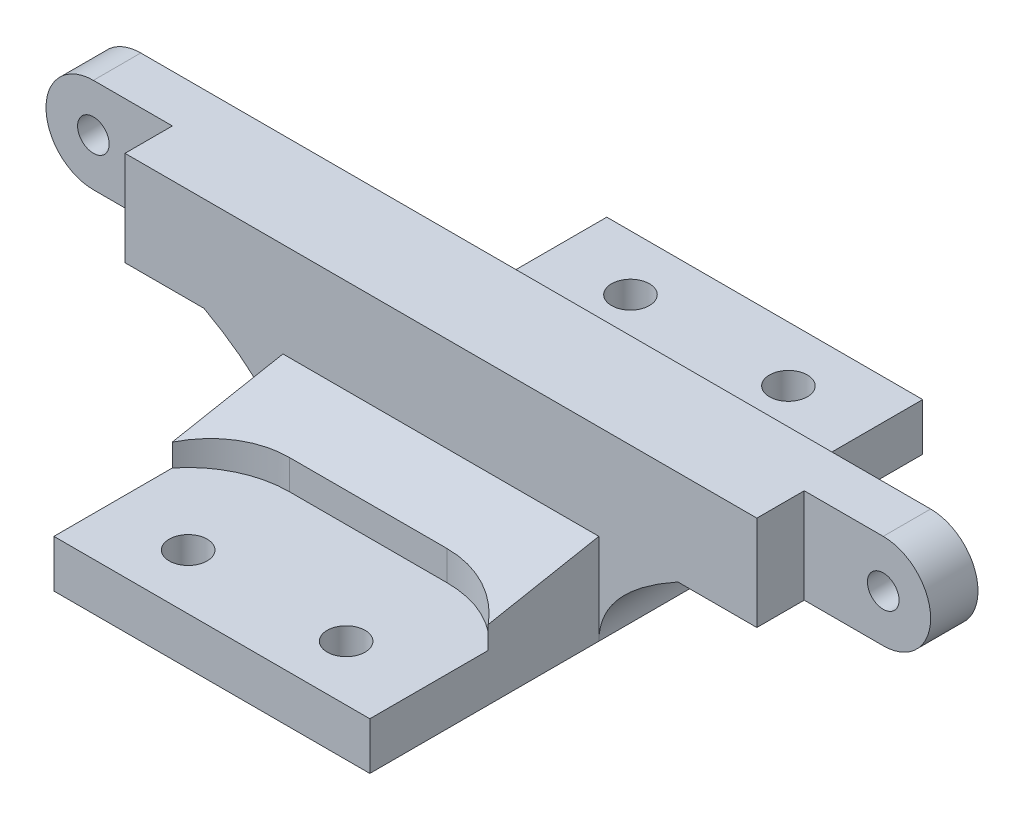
from build123d import *

# Parameters (mm, degrees)
SKETCH1_W           = 25.4
SKETCH1_H           = 7.3025
SKETCH1_H_2         = 3.131062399
BOSS_EXTRUDE1_DEPTH = 3.81
BOSS_EXTRUDE2_DEPTH = 12.7
CUT_EXTRUDE1_DEPTH  = 2.54
CUT_EXTRUDE2_DEPTH  = 11.1125
SKETCH5_R           = 1.524
CUT_EXTRUDE3_DEPTH  = 44.38146933
SKETCH6_W           = 13.854969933
SKETCH6_H           = 8.393619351
SKETCH6_W_2         = 19.426280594
SKETCH6_H_2         = 8.906766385
CUT_EXTRUDE4_DEPTH  = 45.510057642
SKETCH7_R           = 1.27
CUT_EXTRUDE5_DEPTH  = 47.529730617
BOSS_EXTRUDE3_DEPTH = 3.81


with BuildPart() as part:
    # Sketch1 → Boss-Extrude1 (new, symmetric)
    with BuildSketch(Plane.XY):
        with Locations((0, 3.65125)):
            Rectangle(SKETCH1_W, SKETCH1_H)
        with BuildLine():
            Line((31.75, 14.9225), (-31.75, 14.9225))
            ThreePointArc((-31.75, 14.9225), (-35.56, 11.1125), (-31.75, 7.3025))
            Line((-31.75, 7.3025), (-12.7, 7.3025))
            Line((-12.7, 7.3025), (-12.7, 10.433562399))
            Line((-12.7, 10.433562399), (12.7, 10.433562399))
            Line((12.7, 10.433562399), (12.7, 7.3025))
            Line((12.7, 7.3025), (31.75, 7.3025))
            ThreePointArc((31.75, 7.3025), (35.56, 11.1125), (31.75, 14.9225))
        make_face()
        with Locations((0, 8.8680312)):
            Rectangle(SKETCH1_W, SKETCH1_H_2)
    extrude(amount=BOSS_EXTRUDE1_DEPTH, both=True)

    # Sketch2 → Boss-Extrude2 (add, symmetric)
    with BuildSketch(Plane(origin=(0, 0, 0), x_dir=(0, 0, -1), z_dir=(1, 0, 0))):
        Polygon((-3.81, 0), (-22.225, 0), (-22.225, 3.81), (-3.81, 7.3025), align=None)
        Polygon((22.225, 3.81), (3.81, 7.3025), (3.81, 0), (22.225, 0), align=None)
    extrude(amount=BOSS_EXTRUDE2_DEPTH, both=True)

    # Sketch3 → Cut-Extrude1 (cut)
    with BuildSketch(Plane(origin=(0, 0, 0), x_dir=(-1, 0, 0), z_dir=(0, -1, 0))):
        with BuildLine():
            Line((2.54, 9.525), (2.54, -9.525))
            ThreePointArc((2.54, -9.525), (0, -12.065), (-2.54, -9.525))
            Line((-2.54, -9.525), (-2.54, 9.525))
            ThreePointArc((-2.54, 9.525), (0, 12.065), (2.54, 9.525))
        make_face()
    extrude(amount=-CUT_EXTRUDE1_DEPTH, mode=Mode.SUBTRACT)

    # Sketch4 → Cut-Extrude2 (cut)
    with BuildSketch(Plane(origin=(0, 14.9225, 0), x_dir=(1, 0, 0), z_dir=(0, 1, 0))):
        with BuildLine():
            Line((-6.35, -9.652), (6.35, -9.652))
            ThreePointArc((6.35, -9.652), (14.478, -17.78), (6.35, -25.908))
            Line((6.35, -25.908), (-6.35, -25.908))
            ThreePointArc((-6.35, -25.908), (-14.478, -17.78), (-6.35, -9.652))
        make_face()
        with BuildLine():
            Line((-6.35, 9.652), (6.35, 9.652))
            ThreePointArc((6.35, 9.652), (14.478, 17.78), (6.35, 25.908))
            Line((6.35, 25.908), (-6.35, 25.908))
            ThreePointArc((-6.35, 25.908), (-14.478, 17.78), (-6.35, 9.652))
        make_face()
    extrude(amount=-CUT_EXTRUDE2_DEPTH, mode=Mode.SUBTRACT)

    # Sketch5 → Cut-Extrude3 (cut, through all)
    with BuildSketch(Plane(origin=(0, 3.81, 0), x_dir=(1, 0, 0), z_dir=(0, 1, 0))):
        with Locations(Location((-6.35, -17.78, 0), (0, 0, 270))):
            Circle(SKETCH5_R)
        with Locations(Location((6.35, -17.78, 0), (0, 0, 270))):
            Circle(SKETCH5_R)
        with Locations(Location((6.35, 17.78, 0), (0, 0, 270))):
            Circle(SKETCH5_R)
        with Locations(Location((-6.35, 17.78, 0), (0, 0, 270))):
            Circle(SKETCH5_R)
    extrude(amount=-CUT_EXTRUDE3_DEPTH, mode=Mode.SUBTRACT)

    # Sketch6 → Cut-Extrude4 (cut, through all)
    with BuildSketch(Plane(origin=(0, 14.9225, 0), x_dir=(1, 0, 0), z_dir=(0, 1, 0))):
        with Locations((-32.327484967, -4.196809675)):
            Rectangle(SKETCH6_W, SKETCH6_H)
        with Locations((35.113140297, -4.453383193)):
            Rectangle(SKETCH6_W_2, SKETCH6_H_2)
    extrude(amount=-CUT_EXTRUDE4_DEPTH, mode=Mode.SUBTRACT)

    # Sketch7 → Cut-Extrude5 (cut, through all)
    with BuildSketch(Plane(origin=(0, 0, -3.81), x_dir=(-1, 0, 0), z_dir=(0, 0, -1))):
        with Locations((-31.75, 11.1125)):
            Circle(SKETCH7_R)
        with Locations((31.75, 11.1125)):
            Circle(SKETCH7_R)
    extrude(amount=-CUT_EXTRUDE5_DEPTH, mode=Mode.SUBTRACT)

    # Sketch8 → Boss-Extrude3 (add, symmetric)
    with BuildSketch(Plane.XY):
        with BuildLine():
            Line((-19.05, 7.3025), (-12.7, 7.3025))
            Line((-12.7, 7.3025), (-12.7, 0))
            add(Edge.make_bspline(
                [(-12.7, 0), (-12.7, 3.81), (-19.05, 7.3025)],
                knots=[0, 0, 0, 1, 1, 1], degree=2))
        make_face()
        with BuildLine():
            Line((19.05, 7.3025), (12.7, 7.3025))
            Line((12.7, 7.3025), (12.7, 0))
            add(Edge.make_bspline(
                [(12.7, 0), (12.7, 3.81), (19.05, 7.3025)],
                knots=[0, 0, 0, 1, 1, 1], degree=2))
        make_face()
    extrude(amount=BOSS_EXTRUDE3_DEPTH, both=True)


solid = part.part
